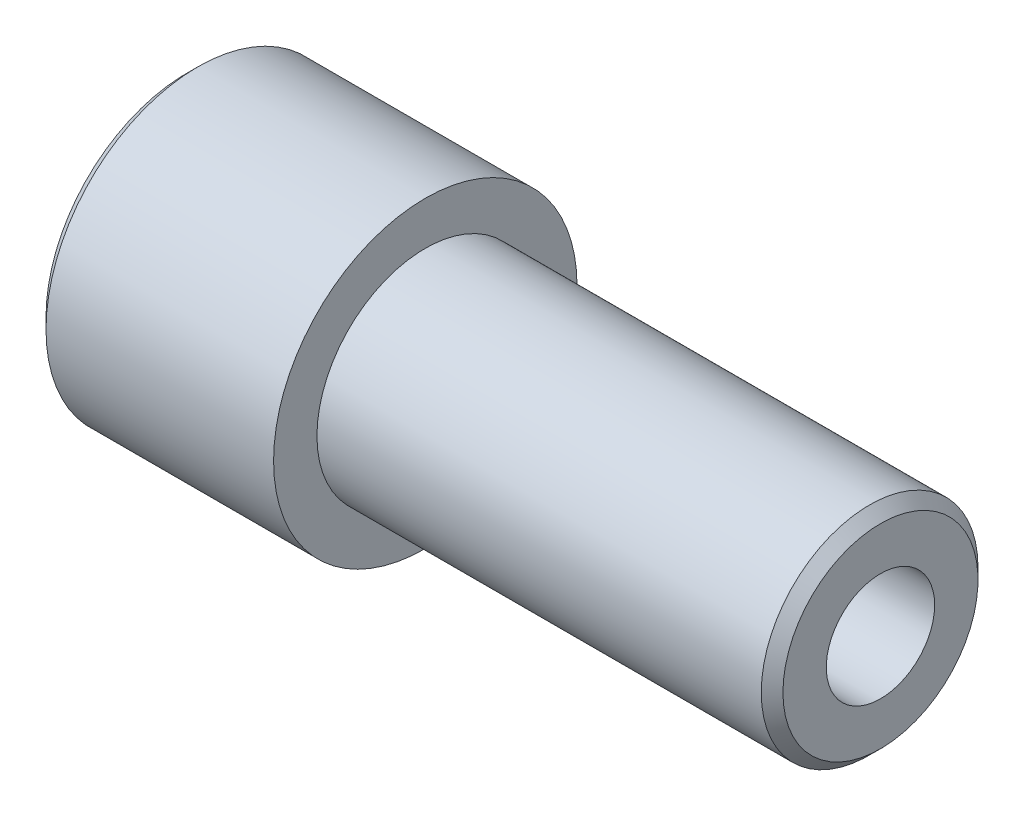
ISO-10303-21;
HEADER;
FILE_DESCRIPTION(('STEP AP214'),'2;1');
FILE_NAME('part.step','',(''),(''),'','','');
FILE_SCHEMA(('AUTOMOTIVE_DESIGN { 1 0 10303 214 1 1 1 1 }'));
ENDSEC;
DATA;
#1=APPLICATION_CONTEXT('core data for automotive mechanical design processes');
#2=APPLICATION_PROTOCOL_DEFINITION('international standard','automotive_design',2000,#1);
#3=PRODUCT_CONTEXT('',#1,'mechanical');
#4=PRODUCT('Part','Part','',(#3));
#5=PRODUCT_RELATED_PRODUCT_CATEGORY('part','',(#4));
#6=PRODUCT_DEFINITION_FORMATION('','',#4);
#7=PRODUCT_DEFINITION_CONTEXT('part definition',#1,'design');
#8=PRODUCT_DEFINITION('design','',#6,#7);
#9=PRODUCT_DEFINITION_SHAPE('','',#8);
#10=(LENGTH_UNIT() NAMED_UNIT(*) SI_UNIT(.MILLI.,.METRE.));
#11=(NAMED_UNIT(*) PLANE_ANGLE_UNIT() SI_UNIT($,.RADIAN.));
#12=(NAMED_UNIT(*) SI_UNIT($,.STERADIAN.) SOLID_ANGLE_UNIT());
#13=UNCERTAINTY_MEASURE_WITH_UNIT(LENGTH_MEASURE(1.E-05),#10,'distance_accuracy_value','');
#14=(GEOMETRIC_REPRESENTATION_CONTEXT(3) GLOBAL_UNCERTAINTY_ASSIGNED_CONTEXT((#13)) GLOBAL_UNIT_ASSIGNED_CONTEXT((#10,
#11,#12)) REPRESENTATION_CONTEXT('',''));
#15=CARTESIAN_POINT('',(0.,0.,0.));
#16=DIRECTION('',(0.,0.,1.));
#17=DIRECTION('',(1.,0.,0.));
#18=AXIS2_PLACEMENT_3D('',#15,#16,#17);
#19=CARTESIAN_POINT('',(0.,0.,0.));
#20=DIRECTION('',(1.,0.,0.));
#21=DIRECTION('',(0.,0.,-1.));
#22=AXIS2_PLACEMENT_3D('',#19,#20,#21);
#23=PLANE('',#22);
#24=CARTESIAN_POINT('',(0.,0.,0.));
#25=DIRECTION('',(1.,0.,0.));
#26=DIRECTION('',(0.,0.,-1.));
#27=AXIS2_PLACEMENT_3D('',#24,#25,#26);
#28=CIRCLE('',#27,6.5);
#29=CARTESIAN_POINT('',(0.,0.,-6.5));
#30=VERTEX_POINT('',#29);
#31=EDGE_CURVE('E43',#30,#30,#28,.F.);
#32=ORIENTED_EDGE('',*,*,#31,.T.);
#33=EDGE_LOOP('',(#32));
#34=FACE_BOUND('',#33,.T.);
#35=ADVANCED_FACE('F36',(#34),#23,.F.);
#36=CARTESIAN_POINT('',(0.,0.,0.));
#37=DIRECTION('',(-1.,0.,0.));
#38=DIRECTION('',(0.,0.,1.));
#39=AXIS2_PLACEMENT_3D('',#36,#37,#38);
#40=CYLINDRICAL_SURFACE('',#39,7.);
#41=CARTESIAN_POINT('',(0.499999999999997,0.,0.));
#42=DIRECTION('',(1.,0.,0.));
#43=DIRECTION('',(0.,0.,-1.));
#44=AXIS2_PLACEMENT_3D('',#41,#42,#43);
#45=CIRCLE('',#44,7.);
#46=CARTESIAN_POINT('',(0.499999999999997,0.,-7.));
#47=VERTEX_POINT('',#46);
#48=EDGE_CURVE('E11',#47,#47,#45,.T.);
#49=ORIENTED_EDGE('',*,*,#48,.T.);
#50=EDGE_LOOP('',(#49));
#51=FACE_BOUND('',#50,.T.);
#52=CARTESIAN_POINT('',(11.,0.,0.));
#53=DIRECTION('',(-1.,0.,0.));
#54=DIRECTION('',(0.,0.,1.));
#55=AXIS2_PLACEMENT_3D('',#52,#53,#54);
#56=CIRCLE('',#55,7.);
#57=CARTESIAN_POINT('',(11.,0.,7.));
#58=VERTEX_POINT('',#57);
#59=EDGE_CURVE('E60',#58,#58,#56,.T.);
#60=ORIENTED_EDGE('',*,*,#59,.T.);
#61=EDGE_LOOP('',(#60));
#62=FACE_BOUND('',#61,.T.);
#63=ADVANCED_FACE('F85',(#51,#62),#40,.T.);
#64=CARTESIAN_POINT('',(11.,7.,0.));
#65=DIRECTION('',(-1.,0.,0.));
#66=DIRECTION('',(0.,0.,1.));
#67=AXIS2_PLACEMENT_3D('',#64,#65,#66);
#68=PLANE('',#67);
#69=ORIENTED_EDGE('',*,*,#59,.F.);
#70=EDGE_LOOP('',(#69));
#71=FACE_BOUND('',#70,.T.);
#72=CARTESIAN_POINT('',(11.,0.,0.));
#73=DIRECTION('',(-1.,0.,0.));
#74=DIRECTION('',(0.,0.,1.));
#75=AXIS2_PLACEMENT_3D('',#72,#73,#74);
#76=CIRCLE('',#75,5.);
#77=CARTESIAN_POINT('',(11.,0.,5.));
#78=VERTEX_POINT('',#77);
#79=EDGE_CURVE('E56',#78,#78,#76,.T.);
#80=ORIENTED_EDGE('',*,*,#79,.T.);
#81=EDGE_LOOP('',(#80));
#82=FACE_BOUND('',#81,.T.);
#83=ADVANCED_FACE('F90',(#71,#82),#68,.F.);
#84=CARTESIAN_POINT('',(0.,0.,0.));
#85=DIRECTION('',(-1.,0.,0.));
#86=DIRECTION('',(0.,0.,1.));
#87=AXIS2_PLACEMENT_3D('',#84,#85,#86);
#88=CYLINDRICAL_SURFACE('',#87,5.);
#89=CARTESIAN_POINT('',(31.5,0.,0.));
#90=DIRECTION('',(-1.,0.,0.));
#91=DIRECTION('',(0.,0.,1.));
#92=AXIS2_PLACEMENT_3D('',#89,#90,#91);
#93=CIRCLE('',#92,5.);
#94=CARTESIAN_POINT('',(31.5,0.,5.));
#95=VERTEX_POINT('',#94);
#96=EDGE_CURVE('E67',#95,#95,#93,.T.);
#97=ORIENTED_EDGE('',*,*,#96,.T.);
#98=EDGE_LOOP('',(#97));
#99=FACE_BOUND('',#98,.T.);
#100=ORIENTED_EDGE('',*,*,#79,.F.);
#101=EDGE_LOOP('',(#100));
#102=FACE_BOUND('',#101,.T.);
#103=ADVANCED_FACE('F96',(#99,#102),#88,.T.);
#104=CARTESIAN_POINT('',(32.,5.,0.));
#105=DIRECTION('',(-1.,0.,0.));
#106=DIRECTION('',(0.,0.,1.));
#107=AXIS2_PLACEMENT_3D('',#104,#105,#106);
#108=PLANE('',#107);
#109=CARTESIAN_POINT('',(32.,0.,0.));
#110=DIRECTION('',(-1.,0.,0.));
#111=DIRECTION('',(0.,0.,1.));
#112=AXIS2_PLACEMENT_3D('',#109,#110,#111);
#113=CIRCLE('',#112,4.5);
#114=CARTESIAN_POINT('',(32.,0.,4.5));
#115=VERTEX_POINT('',#114);
#116=EDGE_CURVE('E70',#115,#115,#113,.F.);
#117=ORIENTED_EDGE('',*,*,#116,.T.);
#118=EDGE_LOOP('',(#117));
#119=FACE_BOUND('',#118,.T.);
#120=CARTESIAN_POINT('',(32.,0.,0.));
#121=DIRECTION('',(1.,0.,0.));
#122=DIRECTION('',(0.,0.,-1.));
#123=AXIS2_PLACEMENT_3D('',#120,#121,#122);
#124=CIRCLE('',#123,2.5);
#125=CARTESIAN_POINT('',(32.,0.,-2.5));
#126=VERTEX_POINT('',#125);
#127=EDGE_CURVE('E57',#126,#126,#124,.T.);
#128=ORIENTED_EDGE('',*,*,#127,.F.);
#129=EDGE_LOOP('',(#128));
#130=FACE_BOUND('',#129,.T.);
#131=ADVANCED_FACE('F50',(#119,#130),#108,.F.);
#132=CARTESIAN_POINT('',(12.,0.,0.));
#133=DIRECTION('',(1.,0.,0.));
#134=DIRECTION('',(0.,0.,-1.));
#135=AXIS2_PLACEMENT_3D('',#132,#133,#134);
#136=CONICAL_SURFACE('',#135,2.49999999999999,1.02974425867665);
#137=CARTESIAN_POINT('',(10.4978484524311,0.,0.));
#138=VERTEX_POINT('',#137);
#139=VERTEX_LOOP('',#138);
#140=FACE_BOUND('',#139,.T.);
#141=CARTESIAN_POINT('',(12.,0.,0.));
#142=DIRECTION('',(1.,0.,0.));
#143=DIRECTION('',(0.,0.,-1.));
#144=AXIS2_PLACEMENT_3D('',#141,#142,#143);
#145=CIRCLE('',#144,2.49999999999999);
#146=CARTESIAN_POINT('',(12.,0.,-2.49999999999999));
#147=VERTEX_POINT('',#146);
#148=EDGE_CURVE('E54',#147,#147,#145,.T.);
#149=ORIENTED_EDGE('',*,*,#148,.T.);
#150=EDGE_LOOP('',(#149));
#151=FACE_BOUND('',#150,.T.);
#152=ADVANCED_FACE('F46',(#140,#151),#136,.F.);
#153=CARTESIAN_POINT('',(32.,0.,0.));
#154=DIRECTION('',(1.,0.,0.));
#155=DIRECTION('',(0.,0.,-1.));
#156=AXIS2_PLACEMENT_3D('',#153,#154,#155);
#157=CYLINDRICAL_SURFACE('',#156,2.5);
#158=ORIENTED_EDGE('',*,*,#148,.F.);
#159=EDGE_LOOP('',(#158));
#160=FACE_BOUND('',#159,.T.);
#161=ORIENTED_EDGE('',*,*,#127,.T.);
#162=EDGE_LOOP('',(#161));
#163=FACE_BOUND('',#162,.T.);
#164=ADVANCED_FACE('F49',(#160,#163),#157,.F.);
#165=CARTESIAN_POINT('',(31.5,0.,0.));
#166=DIRECTION('',(-1.,0.,0.));
#167=DIRECTION('',(0.,0.,1.));
#168=AXIS2_PLACEMENT_3D('',#165,#166,#167);
#169=CONICAL_SURFACE('',#168,5.,0.785398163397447);
#170=ORIENTED_EDGE('',*,*,#116,.F.);
#171=EDGE_LOOP('',(#170));
#172=FACE_BOUND('',#171,.T.);
#173=ORIENTED_EDGE('',*,*,#96,.F.);
#174=EDGE_LOOP('',(#173));
#175=FACE_BOUND('',#174,.T.);
#176=ADVANCED_FACE('F77',(#172,#175),#169,.T.);
#177=CARTESIAN_POINT('',(0.,0.,0.));
#178=DIRECTION('',(1.,0.,0.));
#179=DIRECTION('',(0.,0.,-1.));
#180=AXIS2_PLACEMENT_3D('',#177,#178,#179);
#181=CONICAL_SURFACE('',#180,6.5,0.785398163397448);
#182=ORIENTED_EDGE('',*,*,#48,.F.);
#183=EDGE_LOOP('',(#182));
#184=FACE_BOUND('',#183,.T.);
#185=ORIENTED_EDGE('',*,*,#31,.F.);
#186=EDGE_LOOP('',(#185));
#187=FACE_BOUND('',#186,.T.);
#188=ADVANCED_FACE('F38',(#184,#187),#181,.T.);
#189=CLOSED_SHELL('',(#35,#63,#83,#103,#131,#152,#164,#176,#188));
#190=MANIFOLD_SOLID_BREP('B2',#189);
#191=ADVANCED_BREP_SHAPE_REPRESENTATION('',(#18,#190),#14);
#192=SHAPE_DEFINITION_REPRESENTATION(#9,#191);
ENDSEC;
END-ISO-10303-21;
